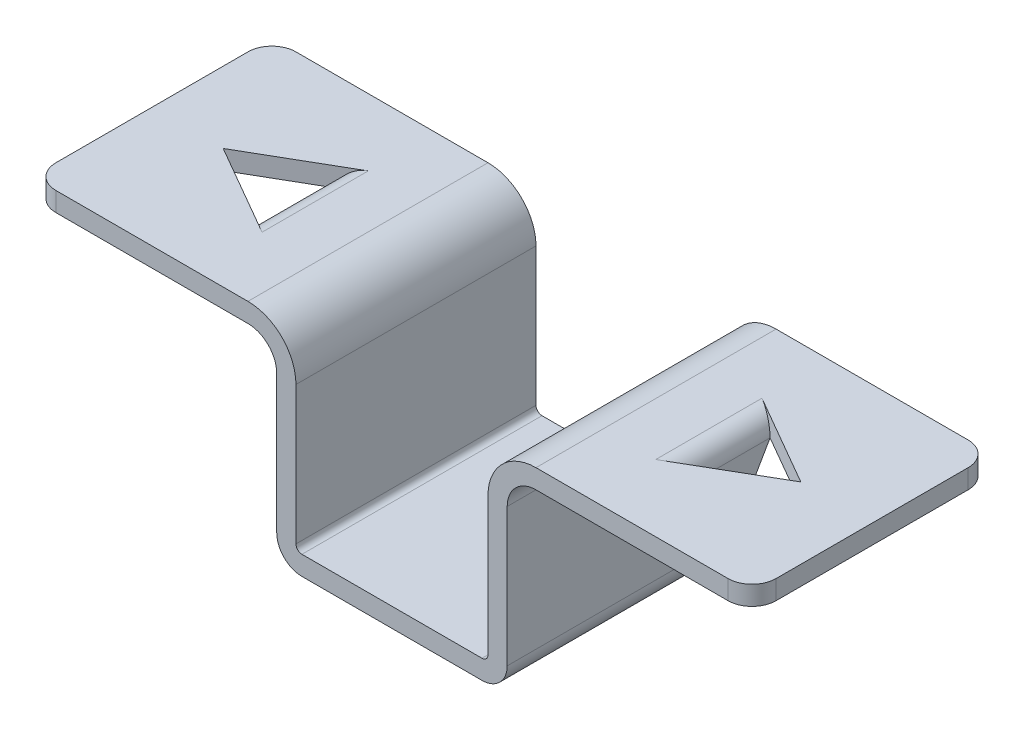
from build123d import *

# Parameters (mm, degrees)
BOSS_EXTRU_1_DEPTH      = 5
ENL_V_MAT_EXTRU_1_DEPTH = 19.095303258
BOSS_EXTRU_2_DEPTH      = 0.8
CONG_1_R                = 0.8
CONG_2_R                = 1


with BuildPart() as part:
    # Esquisse1 → Boss.-Extru.1 (new, symmetric)
    with BuildSketch(Plane.XY):
        with BuildLine():
            Line((-15, 0), (-6, 0))
            ThreePointArc((-6, 0), (-4.585786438, -0.585786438), (-4, -2))
            Line((-4, -2), (-4, -7.75))
            ThreePointArc((-4, -7.75), (-3.926776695, -7.926776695), (-3.75, -8))
            Line((-3.75, -8), (3.75, -8))
            ThreePointArc((3.75, -8), (3.926776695, -7.926776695), (4, -7.75))
            Line((4, -7.75), (4, -2))
            ThreePointArc((4, -2), (4.585786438, -0.585786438), (6, 0))
            Line((6, 0), (15, 0))
            Line((15, 0), (15, -0.8))
            Line((15, -0.8), (6, -0.8))
            ThreePointArc((6, -0.8), (5.151471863, -1.151471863), (4.8, -2))
            Line((4.8, -2), (4.8, -7.75))
            ThreePointArc((4.8, -7.75), (4.49246212, -8.49246212), (3.75, -8.8))
            Line((3.75, -8.8), (-3.75, -8.8))
            ThreePointArc((-3.75, -8.8), (-4.49246212, -8.49246212), (-4.8, -7.75))
            Line((-4.8, -7.75), (-4.8, -2))
            ThreePointArc((-4.8, -2), (-5.151471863, -1.151471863), (-6, -0.8))
            Line((-6, -0.8), (-15, -0.8))
            Line((-15, -0.8), (-15, 0))
        make_face()
    extrude(amount=BOSS_EXTRU_1_DEPTH, both=True)

    # Esquisse2 → Enl_v. mat.-Extru.1 (cut, through all)
    with BuildSketch(Plane(origin=(0, 0, 0), x_dir=(1, 0, 0), z_dir=(0, 1, 0))):
        Polygon((-9, 1.75), (-9, -1.75), (-12.031088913, 0), align=None)
        Polygon((12.031088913, 0), (9, 1.75), (9, -1.75), align=None)
    extrude(amount=-ENL_V_MAT_EXTRU_1_DEPTH, mode=Mode.SUBTRACT)

    # Esquisse3 → Boss.-Extru.2 (add)
    with BuildSketch(Plane.ZY.offset(9)):
        Polygon((1.75, -0.8), (0, -3.831088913), (-1.75, -0.8), align=None)
    boss_extru_2 = extrude(amount=-BOSS_EXTRU_2_DEPTH)

    # Sym_trie2: Boss.-Extru.2 across plane
    add(boss_extru_2.mirror(Plane(origin=(0, 0, 0), x_dir=(0, 0, 1), z_dir=(1, 0, 0))))

    # Cong_1
    cong_1_edges = [part.edges().sort_by_distance(p)[0] for p in [
        (-9, 0, 0),
        (9, 0, 0),
    ]]
    fillet(cong_1_edges, radius=CONG_1_R)

    # Cong_2
    cong_2_edges = [part.edges().sort_by_distance(p)[0] for p in [
        (15, -0.4, -5),
        (-15, -0.4, -5),
        (15, -0.4, 5),
        (-15, -0.4, 5),
    ]]
    fillet(cong_2_edges, radius=CONG_2_R)


solid = part.part
